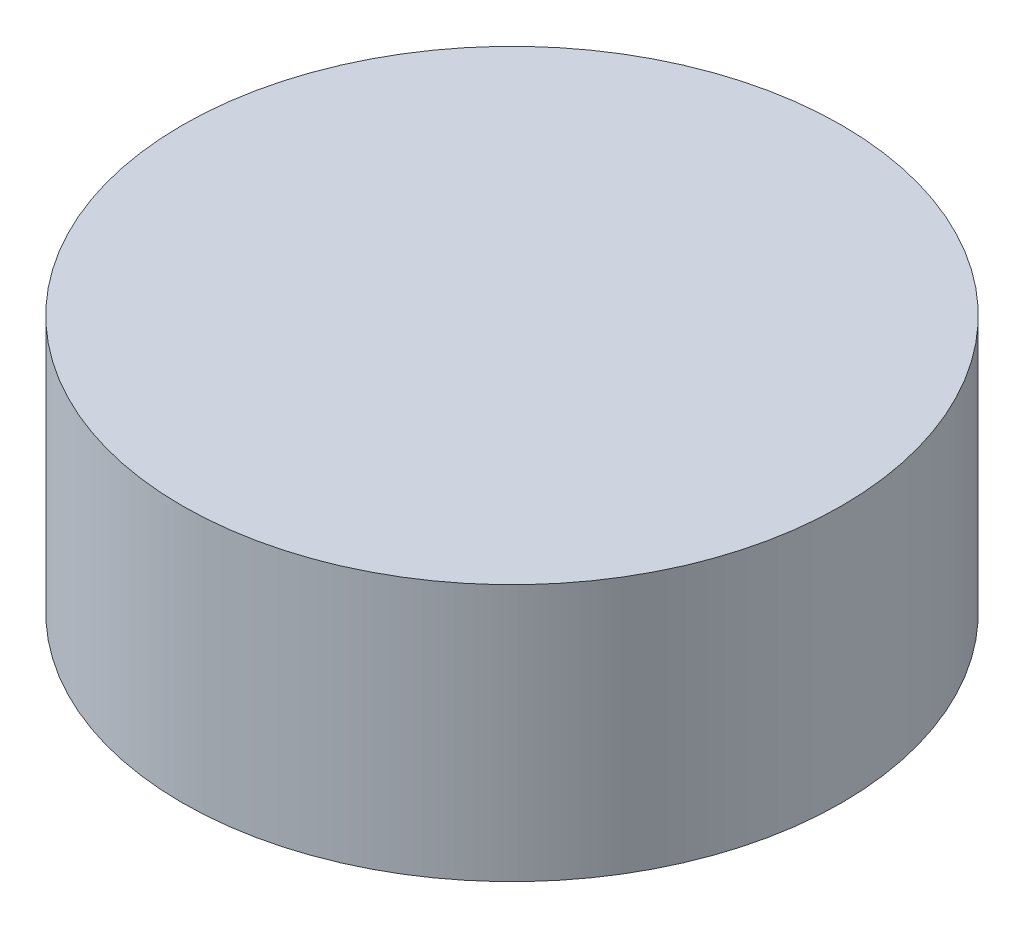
from build123d import *

# Parameters (mm, degrees)
SKETCH1_R           = 19.78
BOSS_EXTRUDE1_DEPTH = 15.43


with BuildPart() as part:
    # Sketch1 → Boss-Extrude1 (new body)
    with BuildSketch(Plane(origin=(0, 0, 0), x_dir=(1, 0, 0), z_dir=(0, 1, 0))):
        with Locations(Location((0, 0, 0), (0, 0, 270))):
            Circle(SKETCH1_R)
    extrude(amount=BOSS_EXTRUDE1_DEPTH)


solid = part.part
